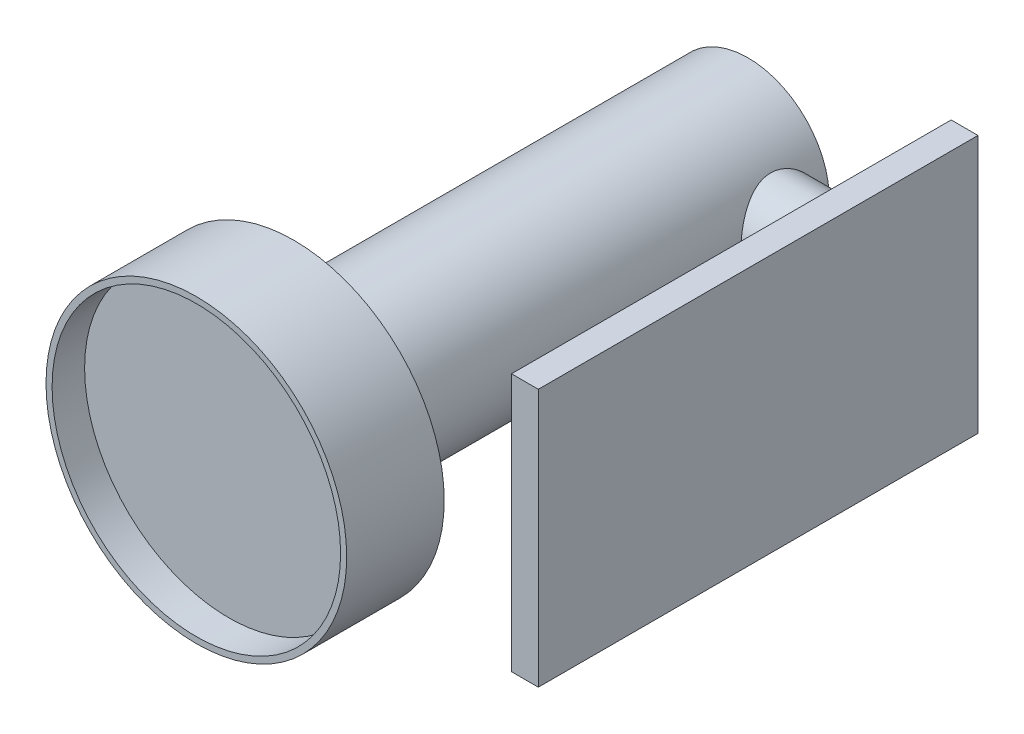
from build123d import *

# Parameters (mm, degrees)
SKETCH1_R           = 18.5
BOSS_EXTRUDE1_DEPTH = 12
SKETCH2_R           = 17.75
CUT_EXTRUDE1_DEPTH  = 4
SKETCH3_R           = 10
BOSS_EXTRUDE2_DEPTH = 55.88
SKETCH4_R           = 5
BOSS_EXTRUDE3_DEPTH = 25
BOSS_EXTRUDE5_DEPTH = 3.302


with BuildPart() as part:
    # Sketch1 → Boss-Extrude1 (new body)
    with BuildSketch(Plane.XY):
        Circle(SKETCH1_R)
    extrude(amount=BOSS_EXTRUDE1_DEPTH)

    # Sketch2 → Cut-Extrude1 (cut)
    with BuildSketch(Plane.XY.offset(12)):
        Circle(SKETCH2_R)
    extrude(amount=-CUT_EXTRUDE1_DEPTH, mode=Mode.SUBTRACT)

    # Sketch3 → Boss-Extrude2 (add)
    with BuildSketch(Plane(origin=(0, 0, 0), x_dir=(-1, 0, 0), z_dir=(0, 0, -1))):
        Circle(SKETCH3_R)
    extrude(amount=BOSS_EXTRUDE2_DEPTH)

    # Sketch4 → Boss-Extrude3 (add)
    with BuildSketch(Plane(origin=(0, 0, 0), x_dir=(0, 0, -1), z_dir=(1, 0, 0))):
        with Locations((50.004627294, 0)):
            Circle(SKETCH4_R)
    extrude(amount=BOSS_EXTRUDE3_DEPTH)

    # Sketch6 → Boss-Extrude5 (add)
    with BuildSketch(Plane(origin=(25, 0, 0), x_dir=(0, 0, -1), z_dir=(1, 0, 0))):
        Polygon((55.88, 0), (55.88, 15.875), (1.778, 15.875), (1.778, -15.875), (55.88, -15.875), align=None)
    extrude(amount=BOSS_EXTRUDE5_DEPTH)


solid = part.part
